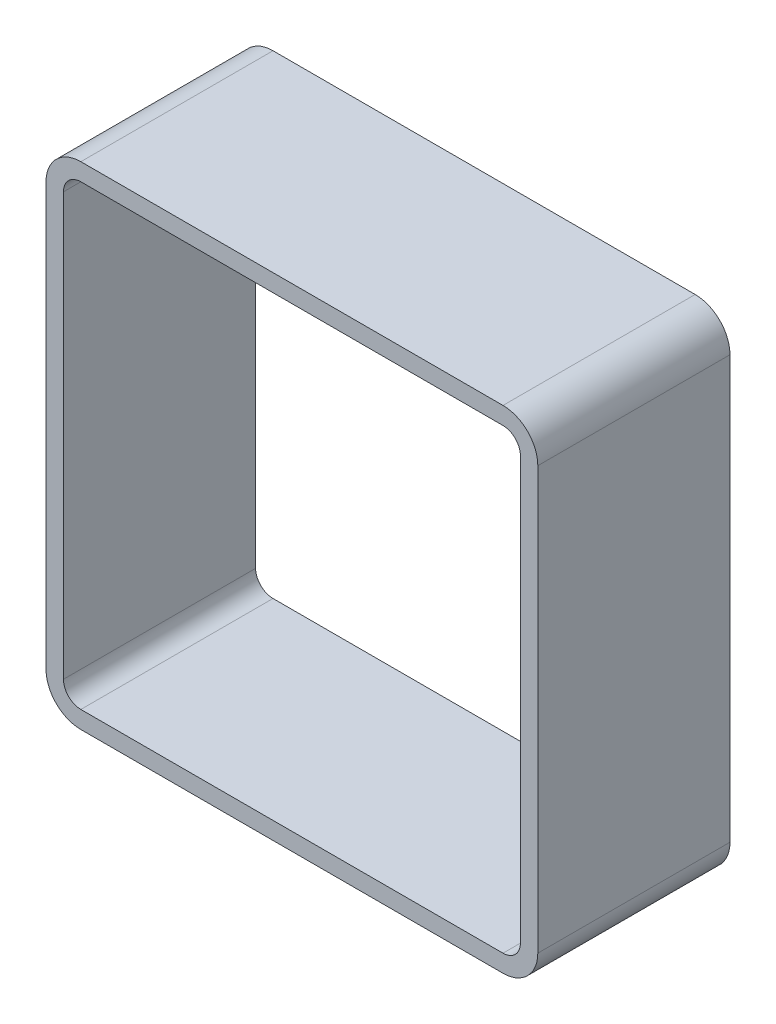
ISO-10303-21;
HEADER;
FILE_DESCRIPTION(('STEP AP214'),'2;1');
FILE_NAME('part.step','',(''),(''),'','','');
FILE_SCHEMA(('AUTOMOTIVE_DESIGN { 1 0 10303 214 1 1 1 1 }'));
ENDSEC;
DATA;
#1=APPLICATION_CONTEXT('core data for automotive mechanical design processes');
#2=APPLICATION_PROTOCOL_DEFINITION('international standard','automotive_design',2000,#1);
#3=PRODUCT_CONTEXT('',#1,'mechanical');
#4=PRODUCT('Part','Part','',(#3));
#5=PRODUCT_RELATED_PRODUCT_CATEGORY('part','',(#4));
#6=PRODUCT_DEFINITION_FORMATION('','',#4);
#7=PRODUCT_DEFINITION_CONTEXT('part definition',#1,'design');
#8=PRODUCT_DEFINITION('design','',#6,#7);
#9=PRODUCT_DEFINITION_SHAPE('','',#8);
#10=(LENGTH_UNIT() NAMED_UNIT(*) SI_UNIT(.MILLI.,.METRE.));
#11=(NAMED_UNIT(*) PLANE_ANGLE_UNIT() SI_UNIT($,.RADIAN.));
#12=(NAMED_UNIT(*) SI_UNIT($,.STERADIAN.) SOLID_ANGLE_UNIT());
#13=UNCERTAINTY_MEASURE_WITH_UNIT(LENGTH_MEASURE(1.E-05),#10,'distance_accuracy_value','');
#14=(GEOMETRIC_REPRESENTATION_CONTEXT(3) GLOBAL_UNCERTAINTY_ASSIGNED_CONTEXT((#13)) GLOBAL_UNIT_ASSIGNED_CONTEXT((#10,
#11,#12)) REPRESENTATION_CONTEXT('',''));
#15=CARTESIAN_POINT('',(0.,0.,0.));
#16=DIRECTION('',(0.,0.,1.));
#17=DIRECTION('',(1.,0.,0.));
#18=AXIS2_PLACEMENT_3D('',#15,#16,#17);
#19=CARTESIAN_POINT('',(-27.9,27.9,12.7));
#20=DIRECTION('',(0.,0.,-1.));
#21=DIRECTION('',(-1.,0.,0.));
#22=AXIS2_PLACEMENT_3D('',#19,#20,#21);
#23=PLANE('',#22);
#24=CARTESIAN_POINT('',(-27.9,27.9,12.7));
#25=DIRECTION('',(0.,0.,1.));
#26=DIRECTION('',(-1.,0.,0.));
#27=AXIS2_PLACEMENT_3D('',#24,#25,#26);
#28=CIRCLE('',#27,4.60000000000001);
#29=CARTESIAN_POINT('',(-27.9,32.5,12.7));
#30=VERTEX_POINT('',#29);
#31=CARTESIAN_POINT('',(-32.5,27.9,12.7));
#32=VERTEX_POINT('',#31);
#33=EDGE_CURVE('E219',#30,#32,#28,.T.);
#34=ORIENTED_EDGE('',*,*,#33,.T.);
#35=DIRECTION('',(0.,-1.,0.));
#36=VECTOR('',#35,1.);
#37=CARTESIAN_POINT('',(-32.5,-27.9,12.7));
#38=LINE('',#37,#36);
#39=CARTESIAN_POINT('',(-32.5,-27.9,12.7));
#40=VERTEX_POINT('',#39);
#41=EDGE_CURVE('E218',#32,#40,#38,.T.);
#42=ORIENTED_EDGE('',*,*,#41,.T.);
#43=CARTESIAN_POINT('',(-27.9,-27.9,12.7));
#44=DIRECTION('',(0.,0.,1.));
#45=DIRECTION('',(-1.,0.,0.));
#46=AXIS2_PLACEMENT_3D('',#43,#44,#45);
#47=CIRCLE('',#46,4.60000000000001);
#48=CARTESIAN_POINT('',(-27.9,-32.5,12.7));
#49=VERTEX_POINT('',#48);
#50=EDGE_CURVE('E223',#40,#49,#47,.T.);
#51=ORIENTED_EDGE('',*,*,#50,.T.);
#52=DIRECTION('',(1.,0.,0.));
#53=VECTOR('',#52,1.);
#54=CARTESIAN_POINT('',(-27.9,-32.5,12.7));
#55=LINE('',#54,#53);
#56=CARTESIAN_POINT('',(27.9,-32.5,12.7));
#57=VERTEX_POINT('',#56);
#58=EDGE_CURVE('E221',#49,#57,#55,.T.);
#59=ORIENTED_EDGE('',*,*,#58,.T.);
#60=CARTESIAN_POINT('',(27.9,-27.9,12.7));
#61=DIRECTION('',(0.,0.,1.));
#62=DIRECTION('',(1.,0.,0.));
#63=AXIS2_PLACEMENT_3D('',#60,#61,#62);
#64=CIRCLE('',#63,4.6);
#65=CARTESIAN_POINT('',(32.5,-27.9,12.7));
#66=VERTEX_POINT('',#65);
#67=EDGE_CURVE('E227',#57,#66,#64,.T.);
#68=ORIENTED_EDGE('',*,*,#67,.T.);
#69=DIRECTION('',(0.,1.,0.));
#70=VECTOR('',#69,1.);
#71=CARTESIAN_POINT('',(32.5,-27.9,12.7));
#72=LINE('',#71,#70);
#73=CARTESIAN_POINT('',(32.5,27.9,12.7));
#74=VERTEX_POINT('',#73);
#75=EDGE_CURVE('E230',#66,#74,#72,.T.);
#76=ORIENTED_EDGE('',*,*,#75,.T.);
#77=CARTESIAN_POINT('',(27.9,27.9,12.7));
#78=DIRECTION('',(0.,0.,1.));
#79=DIRECTION('',(-1.,0.,0.));
#80=AXIS2_PLACEMENT_3D('',#77,#78,#79);
#81=CIRCLE('',#80,4.6);
#82=CARTESIAN_POINT('',(27.9,32.5,12.7));
#83=VERTEX_POINT('',#82);
#84=EDGE_CURVE('E233',#74,#83,#81,.T.);
#85=ORIENTED_EDGE('',*,*,#84,.T.);
#86=DIRECTION('',(-1.,0.,0.));
#87=VECTOR('',#86,1.);
#88=CARTESIAN_POINT('',(-27.9,32.5,12.7));
#89=LINE('',#88,#87);
#90=EDGE_CURVE('E231',#83,#30,#89,.T.);
#91=ORIENTED_EDGE('',*,*,#90,.T.);
#92=EDGE_LOOP('',(#34,#42,#51,#59,#68,#76,#85,#91));
#93=FACE_BOUND('',#92,.T.);
#94=CARTESIAN_POINT('',(-27.9,27.9,12.7));
#95=DIRECTION('',(0.,0.,1.));
#96=DIRECTION('',(-1.,0.,0.));
#97=AXIS2_PLACEMENT_3D('',#94,#95,#96);
#98=CIRCLE('',#97,2.3);
#99=CARTESIAN_POINT('',(-27.9,30.2,12.7));
#100=VERTEX_POINT('',#99);
#101=CARTESIAN_POINT('',(-30.2,27.9,12.7));
#102=VERTEX_POINT('',#101);
#103=EDGE_CURVE('E154',#100,#102,#98,.T.);
#104=ORIENTED_EDGE('',*,*,#103,.F.);
#105=DIRECTION('',(-1.,0.,0.));
#106=VECTOR('',#105,1.);
#107=CARTESIAN_POINT('',(-27.9,30.2,12.7));
#108=LINE('',#107,#106);
#109=CARTESIAN_POINT('',(27.9,30.2,12.7));
#110=VERTEX_POINT('',#109);
#111=EDGE_CURVE('E184',#110,#100,#108,.T.);
#112=ORIENTED_EDGE('',*,*,#111,.F.);
#113=CARTESIAN_POINT('',(27.9,27.9,12.7));
#114=DIRECTION('',(0.,0.,1.));
#115=DIRECTION('',(-1.,0.,0.));
#116=AXIS2_PLACEMENT_3D('',#113,#114,#115);
#117=CIRCLE('',#116,2.3);
#118=CARTESIAN_POINT('',(30.2,27.9,12.7));
#119=VERTEX_POINT('',#118);
#120=EDGE_CURVE('E182',#119,#110,#117,.T.);
#121=ORIENTED_EDGE('',*,*,#120,.F.);
#122=DIRECTION('',(0.,1.,0.));
#123=VECTOR('',#122,1.);
#124=CARTESIAN_POINT('',(30.2,-27.9,12.7));
#125=LINE('',#124,#123);
#126=CARTESIAN_POINT('',(30.2,-27.9,12.7));
#127=VERTEX_POINT('',#126);
#128=EDGE_CURVE('E181',#127,#119,#125,.T.);
#129=ORIENTED_EDGE('',*,*,#128,.F.);
#130=CARTESIAN_POINT('',(27.9,-27.9,12.7));
#131=DIRECTION('',(0.,0.,1.));
#132=DIRECTION('',(1.,0.,0.));
#133=AXIS2_PLACEMENT_3D('',#130,#131,#132);
#134=CIRCLE('',#133,2.3);
#135=CARTESIAN_POINT('',(27.9,-30.2,12.7));
#136=VERTEX_POINT('',#135);
#137=EDGE_CURVE('E177',#136,#127,#134,.T.);
#138=ORIENTED_EDGE('',*,*,#137,.F.);
#139=DIRECTION('',(1.,0.,0.));
#140=VECTOR('',#139,1.);
#141=CARTESIAN_POINT('',(-27.9,-30.2,12.7));
#142=LINE('',#141,#140);
#143=CARTESIAN_POINT('',(-27.9,-30.2,12.7));
#144=VERTEX_POINT('',#143);
#145=EDGE_CURVE('E174',#144,#136,#142,.T.);
#146=ORIENTED_EDGE('',*,*,#145,.F.);
#147=CARTESIAN_POINT('',(-27.9,-27.9,12.7));
#148=DIRECTION('',(0.,0.,1.));
#149=DIRECTION('',(-1.,0.,0.));
#150=AXIS2_PLACEMENT_3D('',#147,#148,#149);
#151=CIRCLE('',#150,2.3);
#152=CARTESIAN_POINT('',(-30.2,-27.9,12.7));
#153=VERTEX_POINT('',#152);
#154=EDGE_CURVE('E173',#153,#144,#151,.T.);
#155=ORIENTED_EDGE('',*,*,#154,.F.);
#156=DIRECTION('',(0.,-1.,0.));
#157=VECTOR('',#156,1.);
#158=CARTESIAN_POINT('',(-30.2,-27.9,12.7));
#159=LINE('',#158,#157);
#160=EDGE_CURVE('E156',#102,#153,#159,.T.);
#161=ORIENTED_EDGE('',*,*,#160,.F.);
#162=EDGE_LOOP('',(#104,#112,#121,#129,#138,#146,#155,#161));
#163=FACE_BOUND('',#162,.T.);
#164=ADVANCED_FACE('F39',(#93,#163),#23,.F.);
#165=CARTESIAN_POINT('',(-27.9,27.9,-12.7));
#166=DIRECTION('',(0.,0.,-1.));
#167=DIRECTION('',(-1.,0.,0.));
#168=AXIS2_PLACEMENT_3D('',#165,#166,#167);
#169=PLANE('',#168);
#170=CARTESIAN_POINT('',(-27.9,27.9,-12.7));
#171=DIRECTION('',(0.,0.,1.));
#172=DIRECTION('',(-1.,0.,0.));
#173=AXIS2_PLACEMENT_3D('',#170,#171,#172);
#174=CIRCLE('',#173,4.60000000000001);
#175=CARTESIAN_POINT('',(-27.9,32.5,-12.7));
#176=VERTEX_POINT('',#175);
#177=CARTESIAN_POINT('',(-32.5,27.9,-12.7));
#178=VERTEX_POINT('',#177);
#179=EDGE_CURVE('E166',#176,#178,#174,.T.);
#180=ORIENTED_EDGE('',*,*,#179,.F.);
#181=DIRECTION('',(-1.,0.,0.));
#182=VECTOR('',#181,1.);
#183=CARTESIAN_POINT('',(-27.9,32.5,-12.7));
#184=LINE('',#183,#182);
#185=CARTESIAN_POINT('',(27.9,32.5,-12.7));
#186=VERTEX_POINT('',#185);
#187=EDGE_CURVE('E222',#186,#176,#184,.T.);
#188=ORIENTED_EDGE('',*,*,#187,.F.);
#189=CARTESIAN_POINT('',(27.9,27.9,-12.7));
#190=DIRECTION('',(0.,0.,1.));
#191=DIRECTION('',(-1.,0.,0.));
#192=AXIS2_PLACEMENT_3D('',#189,#190,#191);
#193=CIRCLE('',#192,4.6);
#194=CARTESIAN_POINT('',(32.5,27.9,-12.7));
#195=VERTEX_POINT('',#194);
#196=EDGE_CURVE('E247',#195,#186,#193,.T.);
#197=ORIENTED_EDGE('',*,*,#196,.F.);
#198=DIRECTION('',(0.,1.,0.));
#199=VECTOR('',#198,1.);
#200=CARTESIAN_POINT('',(32.5,-27.9,-12.7));
#201=LINE('',#200,#199);
#202=CARTESIAN_POINT('',(32.5,-27.9,-12.7));
#203=VERTEX_POINT('',#202);
#204=EDGE_CURVE('E246',#203,#195,#201,.T.);
#205=ORIENTED_EDGE('',*,*,#204,.F.);
#206=CARTESIAN_POINT('',(27.9,-27.9,-12.7));
#207=DIRECTION('',(0.,0.,1.));
#208=DIRECTION('',(1.,0.,0.));
#209=AXIS2_PLACEMENT_3D('',#206,#207,#208);
#210=CIRCLE('',#209,4.6);
#211=CARTESIAN_POINT('',(27.9,-32.5,-12.7));
#212=VERTEX_POINT('',#211);
#213=EDGE_CURVE('E242',#212,#203,#210,.T.);
#214=ORIENTED_EDGE('',*,*,#213,.F.);
#215=DIRECTION('',(1.,0.,0.));
#216=VECTOR('',#215,1.);
#217=CARTESIAN_POINT('',(-27.9,-32.5,-12.7));
#218=LINE('',#217,#216);
#219=CARTESIAN_POINT('',(-27.9,-32.5,-12.7));
#220=VERTEX_POINT('',#219);
#221=EDGE_CURVE('E245',#220,#212,#218,.T.);
#222=ORIENTED_EDGE('',*,*,#221,.F.);
#223=CARTESIAN_POINT('',(-27.9,-27.9,-12.7));
#224=DIRECTION('',(0.,0.,1.));
#225=DIRECTION('',(-1.,0.,0.));
#226=AXIS2_PLACEMENT_3D('',#223,#224,#225);
#227=CIRCLE('',#226,4.60000000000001);
#228=CARTESIAN_POINT('',(-32.5,-27.9,-12.7));
#229=VERTEX_POINT('',#228);
#230=EDGE_CURVE('E239',#229,#220,#227,.T.);
#231=ORIENTED_EDGE('',*,*,#230,.F.);
#232=DIRECTION('',(0.,-1.,0.));
#233=VECTOR('',#232,1.);
#234=CARTESIAN_POINT('',(-32.5,-27.9,-12.7));
#235=LINE('',#234,#233);
#236=EDGE_CURVE('E238',#178,#229,#235,.T.);
#237=ORIENTED_EDGE('',*,*,#236,.F.);
#238=EDGE_LOOP('',(#180,#188,#197,#205,#214,#222,#231,#237));
#239=FACE_BOUND('',#238,.T.);
#240=DIRECTION('',(-1.,0.,0.));
#241=VECTOR('',#240,1.);
#242=CARTESIAN_POINT('',(-27.9,30.2,-12.7));
#243=LINE('',#242,#241);
#244=CARTESIAN_POINT('',(27.9,30.2,-12.7));
#245=VERTEX_POINT('',#244);
#246=CARTESIAN_POINT('',(-27.9,30.2,-12.7));
#247=VERTEX_POINT('',#246);
#248=EDGE_CURVE('E163',#245,#247,#243,.T.);
#249=ORIENTED_EDGE('',*,*,#248,.T.);
#250=CARTESIAN_POINT('',(-27.9,27.9,-12.7));
#251=DIRECTION('',(0.,0.,1.));
#252=DIRECTION('',(-1.,0.,0.));
#253=AXIS2_PLACEMENT_3D('',#250,#251,#252);
#254=CIRCLE('',#253,2.3);
#255=CARTESIAN_POINT('',(-30.2,27.9,-12.7));
#256=VERTEX_POINT('',#255);
#257=EDGE_CURVE('E65',#247,#256,#254,.T.);
#258=ORIENTED_EDGE('',*,*,#257,.T.);
#259=DIRECTION('',(0.,-1.,0.));
#260=VECTOR('',#259,1.);
#261=CARTESIAN_POINT('',(-30.2,-27.9,-12.7));
#262=LINE('',#261,#260);
#263=CARTESIAN_POINT('',(-30.2,-27.9,-12.7));
#264=VERTEX_POINT('',#263);
#265=EDGE_CURVE('E170',#256,#264,#262,.T.);
#266=ORIENTED_EDGE('',*,*,#265,.T.);
#267=CARTESIAN_POINT('',(-27.9,-27.9,-12.7));
#268=DIRECTION('',(0.,0.,1.));
#269=DIRECTION('',(-1.,0.,0.));
#270=AXIS2_PLACEMENT_3D('',#267,#268,#269);
#271=CIRCLE('',#270,2.3);
#272=CARTESIAN_POINT('',(-27.9,-30.2,-12.7));
#273=VERTEX_POINT('',#272);
#274=EDGE_CURVE('E186',#264,#273,#271,.T.);
#275=ORIENTED_EDGE('',*,*,#274,.T.);
#276=DIRECTION('',(1.,0.,0.));
#277=VECTOR('',#276,1.);
#278=CARTESIAN_POINT('',(-27.9,-30.2,-12.7));
#279=LINE('',#278,#277);
#280=CARTESIAN_POINT('',(27.9,-30.2,-12.7));
#281=VERTEX_POINT('',#280);
#282=EDGE_CURVE('E195',#273,#281,#279,.T.);
#283=ORIENTED_EDGE('',*,*,#282,.T.);
#284=CARTESIAN_POINT('',(27.9,-27.9,-12.7));
#285=DIRECTION('',(0.,0.,1.));
#286=DIRECTION('',(1.,0.,0.));
#287=AXIS2_PLACEMENT_3D('',#284,#285,#286);
#288=CIRCLE('',#287,2.3);
#289=CARTESIAN_POINT('',(30.2,-27.9,-12.7));
#290=VERTEX_POINT('',#289);
#291=EDGE_CURVE('E193',#281,#290,#288,.T.);
#292=ORIENTED_EDGE('',*,*,#291,.T.);
#293=DIRECTION('',(0.,1.,0.));
#294=VECTOR('',#293,1.);
#295=CARTESIAN_POINT('',(30.2,-27.9,-12.7));
#296=LINE('',#295,#294);
#297=CARTESIAN_POINT('',(30.2,27.9,-12.7));
#298=VERTEX_POINT('',#297);
#299=EDGE_CURVE('E200',#290,#298,#296,.T.);
#300=ORIENTED_EDGE('',*,*,#299,.T.);
#301=CARTESIAN_POINT('',(27.9,27.9,-12.7));
#302=DIRECTION('',(0.,0.,1.));
#303=DIRECTION('',(-1.,0.,0.));
#304=AXIS2_PLACEMENT_3D('',#301,#302,#303);
#305=CIRCLE('',#304,2.3);
#306=EDGE_CURVE('E202',#298,#245,#305,.T.);
#307=ORIENTED_EDGE('',*,*,#306,.T.);
#308=EDGE_LOOP('',(#249,#258,#266,#275,#283,#292,#300,#307));
#309=FACE_BOUND('',#308,.T.);
#310=ADVANCED_FACE('F279',(#239,#309),#169,.T.);
#311=CARTESIAN_POINT('',(-27.9,27.9,12.7));
#312=DIRECTION('',(0.,0.,-1.));
#313=DIRECTION('',(-1.,0.,0.));
#314=AXIS2_PLACEMENT_3D('',#311,#312,#313);
#315=CYLINDRICAL_SURFACE('',#314,4.60000000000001);
#316=ORIENTED_EDGE('',*,*,#179,.T.);
#317=DIRECTION('',(0.,0.,-1.));
#318=VECTOR('',#317,1.);
#319=CARTESIAN_POINT('',(-32.5,27.9,12.7));
#320=LINE('',#319,#318);
#321=EDGE_CURVE('E11',#32,#178,#320,.T.);
#322=ORIENTED_EDGE('',*,*,#321,.F.);
#323=ORIENTED_EDGE('',*,*,#33,.F.);
#324=DIRECTION('',(0.,0.,-1.));
#325=VECTOR('',#324,1.);
#326=CARTESIAN_POINT('',(-27.9,32.5,12.7));
#327=LINE('',#326,#325);
#328=EDGE_CURVE('E232',#30,#176,#327,.T.);
#329=ORIENTED_EDGE('',*,*,#328,.T.);
#330=EDGE_LOOP('',(#316,#322,#323,#329));
#331=FACE_BOUND('',#330,.T.);
#332=ADVANCED_FACE('F41',(#331),#315,.T.);
#333=CARTESIAN_POINT('',(-32.5,-27.9,12.7));
#334=DIRECTION('',(1.,0.,0.));
#335=DIRECTION('',(0.,0.,-1.));
#336=AXIS2_PLACEMENT_3D('',#333,#334,#335);
#337=PLANE('',#336);
#338=ORIENTED_EDGE('',*,*,#236,.T.);
#339=DIRECTION('',(0.,0.,-1.));
#340=VECTOR('',#339,1.);
#341=CARTESIAN_POINT('',(-32.5,-27.9,12.7));
#342=LINE('',#341,#340);
#343=EDGE_CURVE('E50',#40,#229,#342,.T.);
#344=ORIENTED_EDGE('',*,*,#343,.F.);
#345=ORIENTED_EDGE('',*,*,#41,.F.);
#346=ORIENTED_EDGE('',*,*,#321,.T.);
#347=EDGE_LOOP('',(#338,#344,#345,#346));
#348=FACE_BOUND('',#347,.T.);
#349=ADVANCED_FACE('F294',(#348),#337,.F.);
#350=CARTESIAN_POINT('',(-27.9,-27.9,12.7));
#351=DIRECTION('',(0.,0.,-1.));
#352=DIRECTION('',(-1.,0.,0.));
#353=AXIS2_PLACEMENT_3D('',#350,#351,#352);
#354=CYLINDRICAL_SURFACE('',#353,4.60000000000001);
#355=ORIENTED_EDGE('',*,*,#230,.T.);
#356=DIRECTION('',(0.,0.,-1.));
#357=VECTOR('',#356,1.);
#358=CARTESIAN_POINT('',(-27.9,-32.5,12.7));
#359=LINE('',#358,#357);
#360=EDGE_CURVE('E263',#49,#220,#359,.T.);
#361=ORIENTED_EDGE('',*,*,#360,.F.);
#362=ORIENTED_EDGE('',*,*,#50,.F.);
#363=ORIENTED_EDGE('',*,*,#343,.T.);
#364=EDGE_LOOP('',(#355,#361,#362,#363));
#365=FACE_BOUND('',#364,.T.);
#366=ADVANCED_FACE('F275',(#365),#354,.T.);
#367=CARTESIAN_POINT('',(-27.9,-32.5,12.7));
#368=DIRECTION('',(0.,1.,0.));
#369=DIRECTION('',(-1.,0.,0.));
#370=AXIS2_PLACEMENT_3D('',#367,#368,#369);
#371=PLANE('',#370);
#372=ORIENTED_EDGE('',*,*,#221,.T.);
#373=DIRECTION('',(0.,0.,-1.));
#374=VECTOR('',#373,1.);
#375=CARTESIAN_POINT('',(27.9,-32.5,12.7));
#376=LINE('',#375,#374);
#377=EDGE_CURVE('E264',#57,#212,#376,.T.);
#378=ORIENTED_EDGE('',*,*,#377,.F.);
#379=ORIENTED_EDGE('',*,*,#58,.F.);
#380=ORIENTED_EDGE('',*,*,#360,.T.);
#381=EDGE_LOOP('',(#372,#378,#379,#380));
#382=FACE_BOUND('',#381,.T.);
#383=ADVANCED_FACE('F281',(#382),#371,.F.);
#384=CARTESIAN_POINT('',(27.9,-27.9,12.7));
#385=DIRECTION('',(0.,0.,-1.));
#386=DIRECTION('',(-1.,0.,0.));
#387=AXIS2_PLACEMENT_3D('',#384,#385,#386);
#388=CYLINDRICAL_SURFACE('',#387,4.6);
#389=ORIENTED_EDGE('',*,*,#213,.T.);
#390=DIRECTION('',(0.,0.,-1.));
#391=VECTOR('',#390,1.);
#392=CARTESIAN_POINT('',(32.5,-27.9,12.7));
#393=LINE('',#392,#391);
#394=EDGE_CURVE('E256',#66,#203,#393,.T.);
#395=ORIENTED_EDGE('',*,*,#394,.F.);
#396=ORIENTED_EDGE('',*,*,#67,.F.);
#397=ORIENTED_EDGE('',*,*,#377,.T.);
#398=EDGE_LOOP('',(#389,#395,#396,#397));
#399=FACE_BOUND('',#398,.T.);
#400=ADVANCED_FACE('F288',(#399),#388,.T.);
#401=CARTESIAN_POINT('',(32.5,-27.9,12.7));
#402=DIRECTION('',(-1.,0.,0.));
#403=DIRECTION('',(0.,0.,1.));
#404=AXIS2_PLACEMENT_3D('',#401,#402,#403);
#405=PLANE('',#404);
#406=ORIENTED_EDGE('',*,*,#204,.T.);
#407=DIRECTION('',(0.,0.,-1.));
#408=VECTOR('',#407,1.);
#409=CARTESIAN_POINT('',(32.5,27.9,12.7));
#410=LINE('',#409,#408);
#411=EDGE_CURVE('E257',#74,#195,#410,.T.);
#412=ORIENTED_EDGE('',*,*,#411,.F.);
#413=ORIENTED_EDGE('',*,*,#75,.F.);
#414=ORIENTED_EDGE('',*,*,#394,.T.);
#415=EDGE_LOOP('',(#406,#412,#413,#414));
#416=FACE_BOUND('',#415,.T.);
#417=ADVANCED_FACE('F308',(#416),#405,.F.);
#418=CARTESIAN_POINT('',(27.9,27.9,12.7));
#419=DIRECTION('',(0.,0.,-1.));
#420=DIRECTION('',(-1.,0.,0.));
#421=AXIS2_PLACEMENT_3D('',#418,#419,#420);
#422=CYLINDRICAL_SURFACE('',#421,4.6);
#423=ORIENTED_EDGE('',*,*,#196,.T.);
#424=DIRECTION('',(0.,0.,-1.));
#425=VECTOR('',#424,1.);
#426=CARTESIAN_POINT('',(27.9,32.5,12.7));
#427=LINE('',#426,#425);
#428=EDGE_CURVE('E254',#83,#186,#427,.T.);
#429=ORIENTED_EDGE('',*,*,#428,.F.);
#430=ORIENTED_EDGE('',*,*,#84,.F.);
#431=ORIENTED_EDGE('',*,*,#411,.T.);
#432=EDGE_LOOP('',(#423,#429,#430,#431));
#433=FACE_BOUND('',#432,.T.);
#434=ADVANCED_FACE('F306',(#433),#422,.T.);
#435=CARTESIAN_POINT('',(-27.9,32.5,12.7));
#436=DIRECTION('',(0.,-1.,0.));
#437=DIRECTION('',(0.,0.,-1.));
#438=AXIS2_PLACEMENT_3D('',#435,#436,#437);
#439=PLANE('',#438);
#440=ORIENTED_EDGE('',*,*,#187,.T.);
#441=ORIENTED_EDGE('',*,*,#328,.F.);
#442=ORIENTED_EDGE('',*,*,#90,.F.);
#443=ORIENTED_EDGE('',*,*,#428,.T.);
#444=EDGE_LOOP('',(#440,#441,#442,#443));
#445=FACE_BOUND('',#444,.T.);
#446=ADVANCED_FACE('F301',(#445),#439,.F.);
#447=CARTESIAN_POINT('',(-27.9,27.9,12.7));
#448=DIRECTION('',(0.,0.,-1.));
#449=DIRECTION('',(-1.,0.,0.));
#450=AXIS2_PLACEMENT_3D('',#447,#448,#449);
#451=CYLINDRICAL_SURFACE('',#450,2.3);
#452=ORIENTED_EDGE('',*,*,#257,.F.);
#453=DIRECTION('',(0.,0.,-1.));
#454=VECTOR('',#453,1.);
#455=CARTESIAN_POINT('',(-27.9,30.2,12.7));
#456=LINE('',#455,#454);
#457=EDGE_CURVE('E157',#100,#247,#456,.T.);
#458=ORIENTED_EDGE('',*,*,#457,.F.);
#459=ORIENTED_EDGE('',*,*,#103,.T.);
#460=DIRECTION('',(0.,0.,-1.));
#461=VECTOR('',#460,1.);
#462=CARTESIAN_POINT('',(-30.2,27.9,12.7));
#463=LINE('',#462,#461);
#464=EDGE_CURVE('E153',#102,#256,#463,.T.);
#465=ORIENTED_EDGE('',*,*,#464,.T.);
#466=EDGE_LOOP('',(#452,#458,#459,#465));
#467=FACE_BOUND('',#466,.T.);
#468=ADVANCED_FACE('F151',(#467),#451,.F.);
#469=CARTESIAN_POINT('',(-30.2,-27.9,12.7));
#470=DIRECTION('',(1.,0.,0.));
#471=DIRECTION('',(0.,0.,-1.));
#472=AXIS2_PLACEMENT_3D('',#469,#470,#471);
#473=PLANE('',#472);
#474=ORIENTED_EDGE('',*,*,#265,.F.);
#475=ORIENTED_EDGE('',*,*,#464,.F.);
#476=ORIENTED_EDGE('',*,*,#160,.T.);
#477=DIRECTION('',(0.,0.,-1.));
#478=VECTOR('',#477,1.);
#479=CARTESIAN_POINT('',(-30.2,-27.9,12.7));
#480=LINE('',#479,#478);
#481=EDGE_CURVE('E169',#153,#264,#480,.T.);
#482=ORIENTED_EDGE('',*,*,#481,.T.);
#483=EDGE_LOOP('',(#474,#475,#476,#482));
#484=FACE_BOUND('',#483,.T.);
#485=ADVANCED_FACE('F165',(#484),#473,.T.);
#486=CARTESIAN_POINT('',(-27.9,-27.9,12.7));
#487=DIRECTION('',(0.,0.,-1.));
#488=DIRECTION('',(-1.,0.,0.));
#489=AXIS2_PLACEMENT_3D('',#486,#487,#488);
#490=CYLINDRICAL_SURFACE('',#489,2.3);
#491=ORIENTED_EDGE('',*,*,#274,.F.);
#492=ORIENTED_EDGE('',*,*,#481,.F.);
#493=ORIENTED_EDGE('',*,*,#154,.T.);
#494=DIRECTION('',(0.,0.,-1.));
#495=VECTOR('',#494,1.);
#496=CARTESIAN_POINT('',(-27.9,-30.2,12.7));
#497=LINE('',#496,#495);
#498=EDGE_CURVE('E211',#144,#273,#497,.T.);
#499=ORIENTED_EDGE('',*,*,#498,.T.);
#500=EDGE_LOOP('',(#491,#492,#493,#499));
#501=FACE_BOUND('',#500,.T.);
#502=ADVANCED_FACE('F333',(#501),#490,.F.);
#503=CARTESIAN_POINT('',(-27.9,-30.2,12.7));
#504=DIRECTION('',(0.,1.,0.));
#505=DIRECTION('',(0.,0.,1.));
#506=AXIS2_PLACEMENT_3D('',#503,#504,#505);
#507=PLANE('',#506);
#508=ORIENTED_EDGE('',*,*,#282,.F.);
#509=ORIENTED_EDGE('',*,*,#498,.F.);
#510=ORIENTED_EDGE('',*,*,#145,.T.);
#511=DIRECTION('',(0.,0.,-1.));
#512=VECTOR('',#511,1.);
#513=CARTESIAN_POINT('',(27.9,-30.2,12.7));
#514=LINE('',#513,#512);
#515=EDGE_CURVE('E215',#136,#281,#514,.T.);
#516=ORIENTED_EDGE('',*,*,#515,.T.);
#517=EDGE_LOOP('',(#508,#509,#510,#516));
#518=FACE_BOUND('',#517,.T.);
#519=ADVANCED_FACE('F340',(#518),#507,.T.);
#520=CARTESIAN_POINT('',(27.9,-27.9,12.7));
#521=DIRECTION('',(0.,0.,-1.));
#522=DIRECTION('',(-1.,0.,0.));
#523=AXIS2_PLACEMENT_3D('',#520,#521,#522);
#524=CYLINDRICAL_SURFACE('',#523,2.3);
#525=ORIENTED_EDGE('',*,*,#291,.F.);
#526=ORIENTED_EDGE('',*,*,#515,.F.);
#527=ORIENTED_EDGE('',*,*,#137,.T.);
#528=DIRECTION('',(0.,0.,-1.));
#529=VECTOR('',#528,1.);
#530=CARTESIAN_POINT('',(30.2,-27.9,12.7));
#531=LINE('',#530,#529);
#532=EDGE_CURVE('E208',#127,#290,#531,.T.);
#533=ORIENTED_EDGE('',*,*,#532,.T.);
#534=EDGE_LOOP('',(#525,#526,#527,#533));
#535=FACE_BOUND('',#534,.T.);
#536=ADVANCED_FACE('F344',(#535),#524,.F.);
#537=CARTESIAN_POINT('',(30.2,-27.9,12.7));
#538=DIRECTION('',(-1.,0.,0.));
#539=DIRECTION('',(0.,-1.,0.));
#540=AXIS2_PLACEMENT_3D('',#537,#538,#539);
#541=PLANE('',#540);
#542=ORIENTED_EDGE('',*,*,#299,.F.);
#543=ORIENTED_EDGE('',*,*,#532,.F.);
#544=ORIENTED_EDGE('',*,*,#128,.T.);
#545=DIRECTION('',(0.,0.,-1.));
#546=VECTOR('',#545,1.);
#547=CARTESIAN_POINT('',(30.2,27.9,12.7));
#548=LINE('',#547,#546);
#549=EDGE_CURVE('E206',#119,#298,#548,.T.);
#550=ORIENTED_EDGE('',*,*,#549,.T.);
#551=EDGE_LOOP('',(#542,#543,#544,#550));
#552=FACE_BOUND('',#551,.T.);
#553=ADVANCED_FACE('F349',(#552),#541,.T.);
#554=CARTESIAN_POINT('',(27.9,27.9,12.7));
#555=DIRECTION('',(0.,0.,-1.));
#556=DIRECTION('',(-1.,0.,0.));
#557=AXIS2_PLACEMENT_3D('',#554,#555,#556);
#558=CYLINDRICAL_SURFACE('',#557,2.3);
#559=ORIENTED_EDGE('',*,*,#306,.F.);
#560=ORIENTED_EDGE('',*,*,#549,.F.);
#561=ORIENTED_EDGE('',*,*,#120,.T.);
#562=DIRECTION('',(0.,0.,-1.));
#563=VECTOR('',#562,1.);
#564=CARTESIAN_POINT('',(27.9,30.2,12.7));
#565=LINE('',#564,#563);
#566=EDGE_CURVE('E53',#110,#245,#565,.T.);
#567=ORIENTED_EDGE('',*,*,#566,.T.);
#568=EDGE_LOOP('',(#559,#560,#561,#567));
#569=FACE_BOUND('',#568,.T.);
#570=ADVANCED_FACE('F352',(#569),#558,.F.);
#571=CARTESIAN_POINT('',(-27.9,30.2,12.7));
#572=DIRECTION('',(0.,-1.,0.));
#573=DIRECTION('',(0.,0.,-1.));
#574=AXIS2_PLACEMENT_3D('',#571,#572,#573);
#575=PLANE('',#574);
#576=ORIENTED_EDGE('',*,*,#248,.F.);
#577=ORIENTED_EDGE('',*,*,#566,.F.);
#578=ORIENTED_EDGE('',*,*,#111,.T.);
#579=ORIENTED_EDGE('',*,*,#457,.T.);
#580=EDGE_LOOP('',(#576,#577,#578,#579));
#581=FACE_BOUND('',#580,.T.);
#582=ADVANCED_FACE('F351',(#581),#575,.T.);
#583=CLOSED_SHELL('',(#164,#310,#332,#349,#366,#383,#400,#417,#434,#446,#468,#485,#502,#519,
#536,#553,#570,#582));
#584=MANIFOLD_SOLID_BREP('B2',#583);
#585=ADVANCED_BREP_SHAPE_REPRESENTATION('',(#18,#584),#14);
#586=SHAPE_DEFINITION_REPRESENTATION(#9,#585);
ENDSEC;
END-ISO-10303-21;
